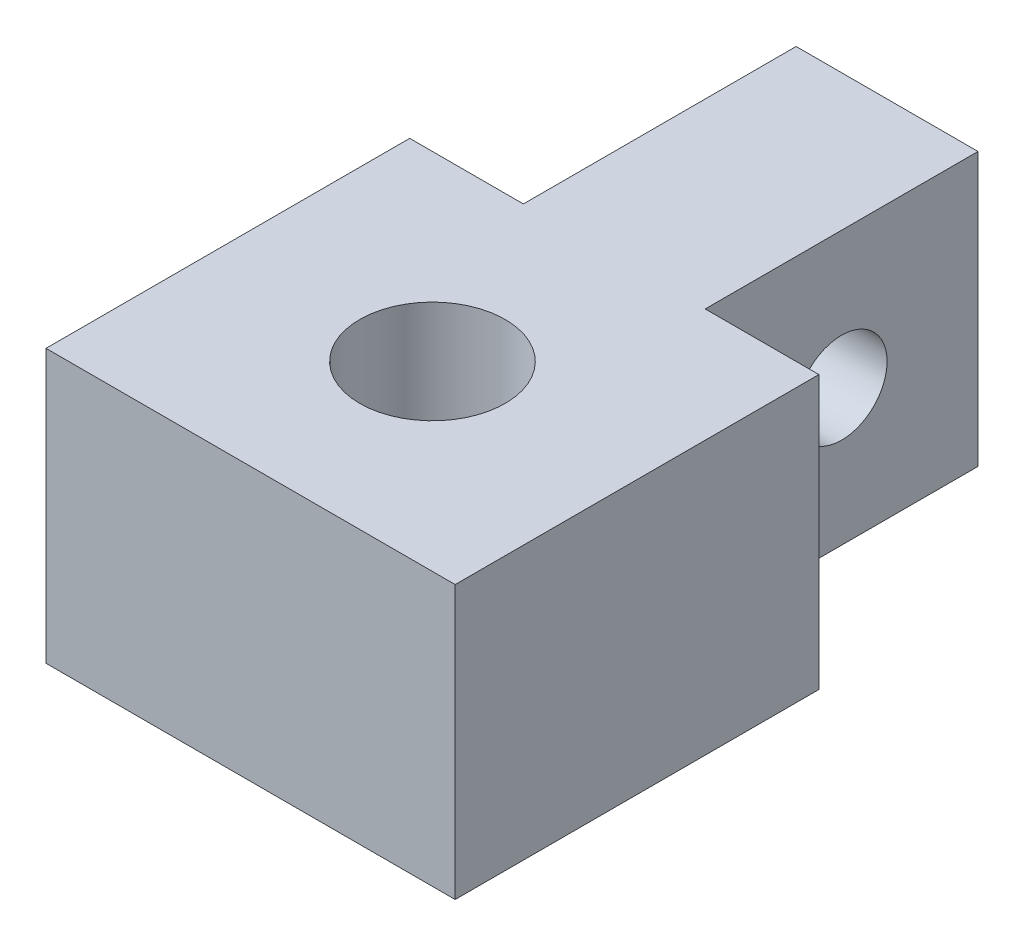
ISO-10303-21;
HEADER;
FILE_DESCRIPTION(('STEP AP214'),'2;1');
FILE_NAME('part.step','',(''),(''),'','','');
FILE_SCHEMA(('AUTOMOTIVE_DESIGN { 1 0 10303 214 1 1 1 1 }'));
ENDSEC;
DATA;
#1=APPLICATION_CONTEXT('core data for automotive mechanical design processes');
#2=APPLICATION_PROTOCOL_DEFINITION('international standard','automotive_design',2000,#1);
#3=PRODUCT_CONTEXT('',#1,'mechanical');
#4=PRODUCT('Part','Part','',(#3));
#5=PRODUCT_RELATED_PRODUCT_CATEGORY('part','',(#4));
#6=PRODUCT_DEFINITION_FORMATION('','',#4);
#7=PRODUCT_DEFINITION_CONTEXT('part definition',#1,'design');
#8=PRODUCT_DEFINITION('design','',#6,#7);
#9=PRODUCT_DEFINITION_SHAPE('','',#8);
#10=(LENGTH_UNIT() NAMED_UNIT(*) SI_UNIT(.MILLI.,.METRE.));
#11=(NAMED_UNIT(*) PLANE_ANGLE_UNIT() SI_UNIT($,.RADIAN.));
#12=(NAMED_UNIT(*) SI_UNIT($,.STERADIAN.) SOLID_ANGLE_UNIT());
#13=UNCERTAINTY_MEASURE_WITH_UNIT(LENGTH_MEASURE(1.E-05),#10,'distance_accuracy_value','');
#14=(GEOMETRIC_REPRESENTATION_CONTEXT(3) GLOBAL_UNCERTAINTY_ASSIGNED_CONTEXT((#13)) GLOBAL_UNIT_ASSIGNED_CONTEXT((#10,
#11,#12)) REPRESENTATION_CONTEXT('',''));
#15=CARTESIAN_POINT('',(0.,0.,0.));
#16=DIRECTION('',(0.,0.,1.));
#17=DIRECTION('',(1.,0.,0.));
#18=AXIS2_PLACEMENT_3D('',#15,#16,#17);
#19=CARTESIAN_POINT('',(0.,3.,-4.));
#20=DIRECTION('',(1.,0.,0.));
#21=DIRECTION('',(0.,0.,-1.));
#22=AXIS2_PLACEMENT_3D('',#19,#20,#21);
#23=PLANE('',#22);
#24=DIRECTION('',(0.,0.,1.));
#25=VECTOR('',#24,1.);
#26=CARTESIAN_POINT('',(0.,0.,-4.));
#27=LINE('',#26,#25);
#28=CARTESIAN_POINT('',(0.,0.,-4.));
#29=VERTEX_POINT('',#28);
#30=CARTESIAN_POINT('',(0.,0.,0.));
#31=VERTEX_POINT('',#30);
#32=EDGE_CURVE('E139',#29,#31,#27,.T.);
#33=ORIENTED_EDGE('',*,*,#32,.T.);
#34=DIRECTION('',(0.,-1.,0.));
#35=VECTOR('',#34,1.);
#36=CARTESIAN_POINT('',(0.,3.,0.));
#37=LINE('',#36,#35);
#38=CARTESIAN_POINT('',(0.,3.,0.));
#39=VERTEX_POINT('',#38);
#40=EDGE_CURVE('E11',#39,#31,#37,.T.);
#41=ORIENTED_EDGE('',*,*,#40,.F.);
#42=DIRECTION('',(0.,0.,1.));
#43=VECTOR('',#42,1.);
#44=CARTESIAN_POINT('',(0.,3.,-4.));
#45=LINE('',#44,#43);
#46=CARTESIAN_POINT('',(0.,3.,-4.));
#47=VERTEX_POINT('',#46);
#48=EDGE_CURVE('E154',#47,#39,#45,.T.);
#49=ORIENTED_EDGE('',*,*,#48,.F.);
#50=DIRECTION('',(0.,-1.,0.));
#51=VECTOR('',#50,1.);
#52=CARTESIAN_POINT('',(0.,3.,-4.));
#53=LINE('',#52,#51);
#54=EDGE_CURVE('E135',#47,#29,#53,.T.);
#55=ORIENTED_EDGE('',*,*,#54,.T.);
#56=EDGE_LOOP('',(#33,#41,#49,#55));
#57=FACE_BOUND('',#56,.T.);
#58=ADVANCED_FACE('F43',(#57),#23,.F.);
#59=CARTESIAN_POINT('',(0.,3.,0.));
#60=DIRECTION('',(0.,0.,-1.));
#61=DIRECTION('',(-1.,0.,0.));
#62=AXIS2_PLACEMENT_3D('',#59,#60,#61);
#63=PLANE('',#62);
#64=DIRECTION('',(1.,0.,0.));
#65=VECTOR('',#64,1.);
#66=CARTESIAN_POINT('',(0.,0.,0.));
#67=LINE('',#66,#65);
#68=CARTESIAN_POINT('',(4.5,0.,0.));
#69=VERTEX_POINT('',#68);
#70=EDGE_CURVE('E142',#31,#69,#67,.T.);
#71=ORIENTED_EDGE('',*,*,#70,.T.);
#72=DIRECTION('',(0.,-1.,0.));
#73=VECTOR('',#72,1.);
#74=CARTESIAN_POINT('',(4.5,3.,0.));
#75=LINE('',#74,#73);
#76=CARTESIAN_POINT('',(4.5,3.,0.));
#77=VERTEX_POINT('',#76);
#78=EDGE_CURVE('E51',#77,#69,#75,.T.);
#79=ORIENTED_EDGE('',*,*,#78,.F.);
#80=DIRECTION('',(1.,0.,0.));
#81=VECTOR('',#80,1.);
#82=CARTESIAN_POINT('',(0.,3.,0.));
#83=LINE('',#82,#81);
#84=EDGE_CURVE('E102',#39,#77,#83,.T.);
#85=ORIENTED_EDGE('',*,*,#84,.F.);
#86=ORIENTED_EDGE('',*,*,#40,.T.);
#87=EDGE_LOOP('',(#71,#79,#85,#86));
#88=FACE_BOUND('',#87,.T.);
#89=ADVANCED_FACE('F214',(#88),#63,.F.);
#90=CARTESIAN_POINT('',(4.5,3.,0.));
#91=DIRECTION('',(-1.,0.,0.));
#92=DIRECTION('',(0.,0.,1.));
#93=AXIS2_PLACEMENT_3D('',#90,#91,#92);
#94=PLANE('',#93);
#95=DIRECTION('',(0.,0.,-1.));
#96=VECTOR('',#95,1.);
#97=CARTESIAN_POINT('',(4.5,0.,0.));
#98=LINE('',#97,#96);
#99=CARTESIAN_POINT('',(4.5,0.,-4.));
#100=VERTEX_POINT('',#99);
#101=EDGE_CURVE('E145',#69,#100,#98,.T.);
#102=ORIENTED_EDGE('',*,*,#101,.T.);
#103=DIRECTION('',(0.,-1.,0.));
#104=VECTOR('',#103,1.);
#105=CARTESIAN_POINT('',(4.5,3.,-4.));
#106=LINE('',#105,#104);
#107=CARTESIAN_POINT('',(4.5,3.,-4.));
#108=VERTEX_POINT('',#107);
#109=EDGE_CURVE('E161',#108,#100,#106,.T.);
#110=ORIENTED_EDGE('',*,*,#109,.F.);
#111=DIRECTION('',(0.,0.,-1.));
#112=VECTOR('',#111,1.);
#113=CARTESIAN_POINT('',(4.5,3.,0.));
#114=LINE('',#113,#112);
#115=EDGE_CURVE('E169',#77,#108,#114,.T.);
#116=ORIENTED_EDGE('',*,*,#115,.F.);
#117=ORIENTED_EDGE('',*,*,#78,.T.);
#118=EDGE_LOOP('',(#102,#110,#116,#117));
#119=FACE_BOUND('',#118,.T.);
#120=ADVANCED_FACE('F167',(#119),#94,.F.);
#121=CARTESIAN_POINT('',(4.5,3.,-4.));
#122=DIRECTION('',(0.,0.,1.));
#123=DIRECTION('',(1.,0.,0.));
#124=AXIS2_PLACEMENT_3D('',#121,#122,#123);
#125=PLANE('',#124);
#126=DIRECTION('',(-1.,0.,0.));
#127=VECTOR('',#126,1.);
#128=CARTESIAN_POINT('',(4.5,0.,-4.));
#129=LINE('',#128,#127);
#130=CARTESIAN_POINT('',(3.25,0.,-4.));
#131=VERTEX_POINT('',#130);
#132=EDGE_CURVE('E147',#100,#131,#129,.T.);
#133=ORIENTED_EDGE('',*,*,#132,.T.);
#134=DIRECTION('',(0.,-1.,0.));
#135=VECTOR('',#134,1.);
#136=CARTESIAN_POINT('',(3.25,3.,-4.));
#137=LINE('',#136,#135);
#138=CARTESIAN_POINT('',(3.25,3.,-4.));
#139=VERTEX_POINT('',#138);
#140=EDGE_CURVE('E158',#139,#131,#137,.T.);
#141=ORIENTED_EDGE('',*,*,#140,.F.);
#142=DIRECTION('',(-1.,0.,0.));
#143=VECTOR('',#142,1.);
#144=CARTESIAN_POINT('',(4.5,3.,-4.));
#145=LINE('',#144,#143);
#146=EDGE_CURVE('E181',#108,#139,#145,.T.);
#147=ORIENTED_EDGE('',*,*,#146,.F.);
#148=ORIENTED_EDGE('',*,*,#109,.T.);
#149=EDGE_LOOP('',(#133,#141,#147,#148));
#150=FACE_BOUND('',#149,.T.);
#151=ADVANCED_FACE('F177',(#150),#125,.F.);
#152=CARTESIAN_POINT('',(3.25,3.,-4.));
#153=DIRECTION('',(-1.,0.,0.));
#154=DIRECTION('',(0.,0.,1.));
#155=AXIS2_PLACEMENT_3D('',#152,#153,#154);
#156=PLANE('',#155);
#157=CARTESIAN_POINT('',(3.25,1.5,-5.5));
#158=DIRECTION('',(1.,0.,0.));
#159=DIRECTION('',(0.,0.,-1.));
#160=AXIS2_PLACEMENT_3D('',#157,#158,#159);
#161=CIRCLE('',#160,0.499999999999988);
#162=CARTESIAN_POINT('',(3.25,1.5,-5.99999999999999));
#163=VERTEX_POINT('',#162);
#164=EDGE_CURVE('E189',#163,#163,#161,.T.);
#165=ORIENTED_EDGE('',*,*,#164,.F.);
#166=EDGE_LOOP('',(#165));
#167=FACE_BOUND('',#166,.T.);
#168=DIRECTION('',(0.,0.,-1.));
#169=VECTOR('',#168,1.);
#170=CARTESIAN_POINT('',(3.25,0.,-4.));
#171=LINE('',#170,#169);
#172=CARTESIAN_POINT('',(3.25,0.,-7.));
#173=VERTEX_POINT('',#172);
#174=EDGE_CURVE('E149',#131,#173,#171,.T.);
#175=ORIENTED_EDGE('',*,*,#174,.T.);
#176=DIRECTION('',(0.,-1.,0.));
#177=VECTOR('',#176,1.);
#178=CARTESIAN_POINT('',(3.25,3.,-7.));
#179=LINE('',#178,#177);
#180=CARTESIAN_POINT('',(3.25,3.,-7.));
#181=VERTEX_POINT('',#180);
#182=EDGE_CURVE('E130',#181,#173,#179,.T.);
#183=ORIENTED_EDGE('',*,*,#182,.F.);
#184=DIRECTION('',(0.,0.,-1.));
#185=VECTOR('',#184,1.);
#186=CARTESIAN_POINT('',(3.25,3.,-4.));
#187=LINE('',#186,#185);
#188=EDGE_CURVE('E121',#139,#181,#187,.T.);
#189=ORIENTED_EDGE('',*,*,#188,.F.);
#190=ORIENTED_EDGE('',*,*,#140,.T.);
#191=EDGE_LOOP('',(#175,#183,#189,#190));
#192=FACE_BOUND('',#191,.T.);
#193=ADVANCED_FACE('F180',(#167,#192),#156,.F.);
#194=CARTESIAN_POINT('',(3.25,3.,-7.));
#195=DIRECTION('',(0.,0.,1.));
#196=DIRECTION('',(1.,0.,0.));
#197=AXIS2_PLACEMENT_3D('',#194,#195,#196);
#198=PLANE('',#197);
#199=DIRECTION('',(-1.,0.,0.));
#200=VECTOR('',#199,1.);
#201=CARTESIAN_POINT('',(3.25,0.,-7.));
#202=LINE('',#201,#200);
#203=CARTESIAN_POINT('',(1.25,0.,-7.));
#204=VERTEX_POINT('',#203);
#205=EDGE_CURVE('E129',#173,#204,#202,.T.);
#206=ORIENTED_EDGE('',*,*,#205,.T.);
#207=DIRECTION('',(0.,-1.,0.));
#208=VECTOR('',#207,1.);
#209=CARTESIAN_POINT('',(1.25,3.,-7.));
#210=LINE('',#209,#208);
#211=CARTESIAN_POINT('',(1.25,3.,-7.));
#212=VERTEX_POINT('',#211);
#213=EDGE_CURVE('E126',#212,#204,#210,.T.);
#214=ORIENTED_EDGE('',*,*,#213,.F.);
#215=DIRECTION('',(-1.,0.,0.));
#216=VECTOR('',#215,1.);
#217=CARTESIAN_POINT('',(3.25,3.,-7.));
#218=LINE('',#217,#216);
#219=EDGE_CURVE('E115',#181,#212,#218,.T.);
#220=ORIENTED_EDGE('',*,*,#219,.F.);
#221=ORIENTED_EDGE('',*,*,#182,.T.);
#222=EDGE_LOOP('',(#206,#214,#220,#221));
#223=FACE_BOUND('',#222,.T.);
#224=ADVANCED_FACE('F127',(#223),#198,.F.);
#225=CARTESIAN_POINT('',(1.25,3.,-7.));
#226=DIRECTION('',(1.,0.,0.));
#227=DIRECTION('',(0.,0.,-1.));
#228=AXIS2_PLACEMENT_3D('',#225,#226,#227);
#229=PLANE('',#228);
#230=CARTESIAN_POINT('',(1.25,1.5,-5.5));
#231=DIRECTION('',(1.,0.,0.));
#232=DIRECTION('',(0.,0.,-1.));
#233=AXIS2_PLACEMENT_3D('',#230,#231,#232);
#234=CIRCLE('',#233,0.499999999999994);
#235=CARTESIAN_POINT('',(1.25,1.5,-5.99999999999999));
#236=VERTEX_POINT('',#235);
#237=EDGE_CURVE('E143',#236,#236,#234,.T.);
#238=ORIENTED_EDGE('',*,*,#237,.T.);
#239=EDGE_LOOP('',(#238));
#240=FACE_BOUND('',#239,.T.);
#241=DIRECTION('',(0.,0.,1.));
#242=VECTOR('',#241,1.);
#243=CARTESIAN_POINT('',(1.25,0.,-7.));
#244=LINE('',#243,#242);
#245=CARTESIAN_POINT('',(1.25,0.,-4.));
#246=VERTEX_POINT('',#245);
#247=EDGE_CURVE('E88',#204,#246,#244,.T.);
#248=ORIENTED_EDGE('',*,*,#247,.T.);
#249=DIRECTION('',(0.,-1.,0.));
#250=VECTOR('',#249,1.);
#251=CARTESIAN_POINT('',(1.25,3.,-4.));
#252=LINE('',#251,#250);
#253=CARTESIAN_POINT('',(1.25,3.,-4.));
#254=VERTEX_POINT('',#253);
#255=EDGE_CURVE('E131',#254,#246,#252,.T.);
#256=ORIENTED_EDGE('',*,*,#255,.F.);
#257=DIRECTION('',(0.,0.,1.));
#258=VECTOR('',#257,1.);
#259=CARTESIAN_POINT('',(1.25,3.,-7.));
#260=LINE('',#259,#258);
#261=EDGE_CURVE('E119',#212,#254,#260,.T.);
#262=ORIENTED_EDGE('',*,*,#261,.F.);
#263=ORIENTED_EDGE('',*,*,#213,.T.);
#264=EDGE_LOOP('',(#248,#256,#262,#263));
#265=FACE_BOUND('',#264,.T.);
#266=ADVANCED_FACE('F133',(#240,#265),#229,.F.);
#267=CARTESIAN_POINT('',(1.25,3.,-4.));
#268=DIRECTION('',(0.,0.,1.));
#269=DIRECTION('',(1.,0.,0.));
#270=AXIS2_PLACEMENT_3D('',#267,#268,#269);
#271=PLANE('',#270);
#272=DIRECTION('',(-1.,0.,0.));
#273=VECTOR('',#272,1.);
#274=CARTESIAN_POINT('',(1.25,0.,-4.));
#275=LINE('',#274,#273);
#276=EDGE_CURVE('E94',#246,#29,#275,.T.);
#277=ORIENTED_EDGE('',*,*,#276,.T.);
#278=ORIENTED_EDGE('',*,*,#54,.F.);
#279=DIRECTION('',(-1.,0.,0.));
#280=VECTOR('',#279,1.);
#281=CARTESIAN_POINT('',(1.25,3.,-4.));
#282=LINE('',#281,#280);
#283=EDGE_CURVE('E59',#254,#47,#282,.T.);
#284=ORIENTED_EDGE('',*,*,#283,.F.);
#285=ORIENTED_EDGE('',*,*,#255,.T.);
#286=EDGE_LOOP('',(#277,#278,#284,#285));
#287=FACE_BOUND('',#286,.T.);
#288=ADVANCED_FACE('F202',(#287),#271,.F.);
#289=CARTESIAN_POINT('',(0.,3.,0.));
#290=DIRECTION('',(0.,1.,0.));
#291=DIRECTION('',(0.,0.,1.));
#292=AXIS2_PLACEMENT_3D('',#289,#290,#291);
#293=PLANE('',#292);
#294=CARTESIAN_POINT('',(2.25,3.,-2.));
#295=DIRECTION('',(0.,1.,0.));
#296=DIRECTION('',(0.,0.,1.));
#297=AXIS2_PLACEMENT_3D('',#294,#295,#296);
#298=CIRCLE('',#297,0.8);
#299=CARTESIAN_POINT('',(2.25,3.,-1.2));
#300=VERTEX_POINT('',#299);
#301=EDGE_CURVE('E195',#300,#300,#298,.T.);
#302=ORIENTED_EDGE('',*,*,#301,.F.);
#303=EDGE_LOOP('',(#302));
#304=FACE_BOUND('',#303,.T.);
#305=ORIENTED_EDGE('',*,*,#48,.T.);
#306=ORIENTED_EDGE('',*,*,#84,.T.);
#307=ORIENTED_EDGE('',*,*,#115,.T.);
#308=ORIENTED_EDGE('',*,*,#146,.T.);
#309=ORIENTED_EDGE('',*,*,#188,.T.);
#310=ORIENTED_EDGE('',*,*,#219,.T.);
#311=ORIENTED_EDGE('',*,*,#261,.T.);
#312=ORIENTED_EDGE('',*,*,#283,.T.);
#313=EDGE_LOOP('',(#305,#306,#307,#308,#309,#310,#311,#312));
#314=FACE_BOUND('',#313,.T.);
#315=ADVANCED_FACE('F117',(#304,#314),#293,.T.);
#316=CARTESIAN_POINT('',(0.,0.,0.));
#317=DIRECTION('',(0.,1.,0.));
#318=DIRECTION('',(0.,0.,1.));
#319=AXIS2_PLACEMENT_3D('',#316,#317,#318);
#320=PLANE('',#319);
#321=CARTESIAN_POINT('',(2.25,0.,-2.));
#322=DIRECTION('',(0.,1.,0.));
#323=DIRECTION('',(0.,0.,1.));
#324=AXIS2_PLACEMENT_3D('',#321,#322,#323);
#325=CIRCLE('',#324,0.799999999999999);
#326=CARTESIAN_POINT('',(2.25,0.,-1.2));
#327=VERTEX_POINT('',#326);
#328=EDGE_CURVE('E192',#327,#327,#325,.T.);
#329=ORIENTED_EDGE('',*,*,#328,.T.);
#330=EDGE_LOOP('',(#329));
#331=FACE_BOUND('',#330,.T.);
#332=ORIENTED_EDGE('',*,*,#32,.F.);
#333=ORIENTED_EDGE('',*,*,#276,.F.);
#334=ORIENTED_EDGE('',*,*,#247,.F.);
#335=ORIENTED_EDGE('',*,*,#205,.F.);
#336=ORIENTED_EDGE('',*,*,#174,.F.);
#337=ORIENTED_EDGE('',*,*,#132,.F.);
#338=ORIENTED_EDGE('',*,*,#101,.F.);
#339=ORIENTED_EDGE('',*,*,#70,.F.);
#340=EDGE_LOOP('',(#332,#333,#334,#335,#336,#337,#338,#339));
#341=FACE_BOUND('',#340,.T.);
#342=ADVANCED_FACE('F173',(#331,#341),#320,.F.);
#343=CARTESIAN_POINT('',(3.25,1.5,-5.5));
#344=DIRECTION('',(1.,0.,0.));
#345=DIRECTION('',(0.,0.,-1.));
#346=AXIS2_PLACEMENT_3D('',#343,#344,#345);
#347=CYLINDRICAL_SURFACE('',#346,0.499999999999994);
#348=ORIENTED_EDGE('',*,*,#237,.F.);
#349=EDGE_LOOP('',(#348));
#350=FACE_BOUND('',#349,.T.);
#351=ORIENTED_EDGE('',*,*,#164,.T.);
#352=EDGE_LOOP('',(#351));
#353=FACE_BOUND('',#352,.T.);
#354=ADVANCED_FACE('F208',(#350,#353),#347,.F.);
#355=CARTESIAN_POINT('',(2.25,3.,-2.));
#356=DIRECTION('',(0.,1.,0.));
#357=DIRECTION('',(0.,0.,1.));
#358=AXIS2_PLACEMENT_3D('',#355,#356,#357);
#359=CYLINDRICAL_SURFACE('',#358,0.799999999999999);
#360=ORIENTED_EDGE('',*,*,#328,.F.);
#361=EDGE_LOOP('',(#360));
#362=FACE_BOUND('',#361,.T.);
#363=ORIENTED_EDGE('',*,*,#301,.T.);
#364=EDGE_LOOP('',(#363));
#365=FACE_BOUND('',#364,.T.);
#366=ADVANCED_FACE('F199',(#362,#365),#359,.F.);
#367=CLOSED_SHELL('',(#58,#89,#120,#151,#193,#224,#266,#288,#315,#342,#354,#366));
#368=MANIFOLD_SOLID_BREP('B2',#367);
#369=ADVANCED_BREP_SHAPE_REPRESENTATION('',(#18,#368),#14);
#370=SHAPE_DEFINITION_REPRESENTATION(#9,#369);
ENDSEC;
END-ISO-10303-21;
